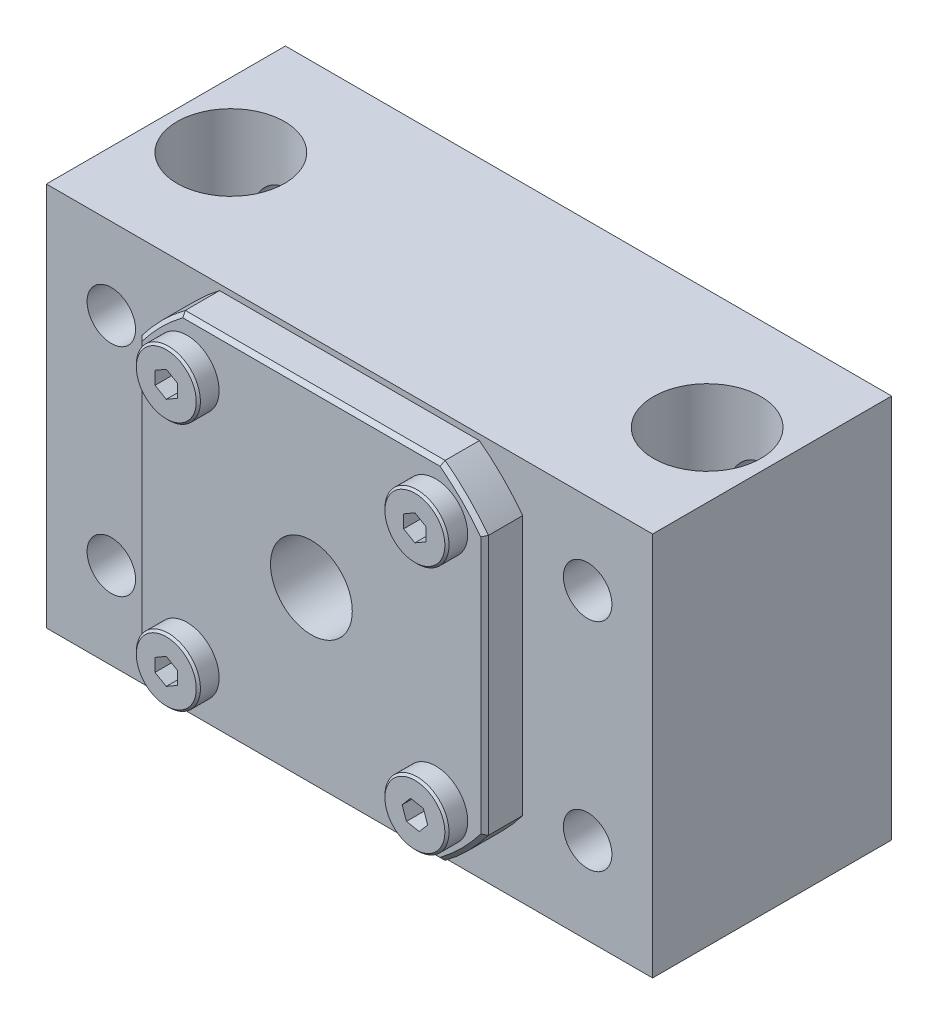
from build123d import *

# Parameters (mm, degrees)
SKETCH1_W           = 88.9
SKETCH1_H           = 35.052
EXTRUDE_B_DEPTH     = 56.388
SKETCH2_R           = 5.207
PHOLES_DEPTH        = 111.957015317
SKETCH3_R           = 7.874
PCBOREDDEPTH_DEPTH  = 25.4
SKETCH4_R           = 3.556
CUT_EXTRUDE3_DEPTH  = 111.957015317
SKETCH5_R           = 6
CUT_EXTRUDE4_DEPTH  = 111.957015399
SQCOVER_START       = 5.588
SKETCH8_W           = 50.8
SKETCH8_H           = 50.8
SKETCH8_R           = 6
SQCOVER_DEPTH       = 5.588
SKETCH9_R           = 152.4
SKETCH9_R_2         = 31.75
CUT_EXTRUDE6_DEPTH  = 5.588
SQCOVERCHAMFER_SIZE = 0.5588
SKETCH10_R          = 4.699
SHCS_DEPTH          = 3.048
SHCS_CHAMFER_SIZE   = 0.3048


with BuildPart() as part:
    # Sketch1 → Extrude B (new body)
    with BuildSketch(Plane(origin=(0, 0, 0), x_dir=(1, 0, 0), z_dir=(0, 1, 0))):
        with Locations((44.45, 17.526)):
            Rectangle(SKETCH1_W, SKETCH1_H)
    extrude(amount=EXTRUDE_B_DEPTH)

    # Sketch2 → PHoles (cut, through all)
    with BuildSketch(Plane(origin=(0, 56.388, 0), x_dir=(-1, 0, 0), z_dir=(0, 1, 0))):
        with Locations(Location((-79.375, -17.526, 0), (0, 0, 90))):
            Circle(SKETCH2_R)
        with Locations(Location((-9.525, -17.526, 0), (0, 0, 90))):
            Circle(SKETCH2_R)
        with Locations((-79.375, 25.908)):
            Circle(SKETCH2_R)
        with Locations((-9.525, 25.908)):
            Circle(SKETCH2_R)
    extrude(amount=-PHOLES_DEPTH, mode=Mode.SUBTRACT)

    # Sketch3 → PcBoredDepth (cut)
    with BuildSketch(Plane(origin=(0, 56.388, 0), x_dir=(-1, 0, 0), z_dir=(0, 1, 0))):
        with Locations(Location((-9.525, -17.526, 0), (0, 0, 90))):
            Circle(SKETCH3_R)
        with Locations(Location((-79.375, -17.526, 0), (0, 0, 90))):
            Circle(SKETCH3_R)
        with Locations((-79.375, 25.908)):
            Circle(SKETCH3_R)
        with Locations((-9.525, 25.908)):
            Circle(SKETCH3_R)
    extrude(amount=-PCBOREDDEPTH_DEPTH, mode=Mode.SUBTRACT)

    # Sketch4 → Cut-Extrude3 (cut, through all)
    with BuildSketch(Plane.XY):
        with Locations((9.525, 44.45)):
            Circle(SKETCH4_R)
        with Locations((9.525, 12.7)):
            Circle(SKETCH4_R)
        with Locations((79.375, 44.45)):
            Circle(SKETCH4_R)
        with Locations((79.375, 12.7)):
            Circle(SKETCH4_R)
        with Locations((9.525, 76.2)):
            Circle(SKETCH4_R)
        with Locations((79.375, 76.2)):
            Circle(SKETCH4_R)
    extrude(amount=-CUT_EXTRUDE3_DEPTH, mode=Mode.SUBTRACT)

    # Sketch5 → Cut-Extrude4 (cut, through all)
    with BuildSketch(Plane.XY):
        with Locations((44.45, 30.1498)):
            Circle(SKETCH5_R)
    extrude(amount=-CUT_EXTRUDE4_DEPTH, mode=Mode.SUBTRACT)

    # Sketch8 → SqCover (add)
    with BuildSketch(Plane.XY.offset(SQCOVER_START)):
        with Locations((44.45, 30.1498)):
            Rectangle(SKETCH8_W, SKETCH8_H)
        with Locations((44.45, 30.1498)):
            Circle(SKETCH8_R, mode=Mode.SUBTRACT)
    extrude(amount=-SQCOVER_DEPTH)

    # Sketch9 → Cut-Extrude6 (cut)
    with BuildSketch(Plane.XY.offset(5.588)):
        with Locations((44.45, 30.1498)):
            Circle(SKETCH9_R)
        with Locations((44.45, 30.1498)):
            Circle(SKETCH9_R_2, mode=Mode.SUBTRACT)
    extrude(amount=-CUT_EXTRUDE6_DEPTH, mode=Mode.SUBTRACT)

    # SqCoverChamfer
    sqcoverchamfer_edges = [part.edges().sort_by_distance(p)[0] for p in [
        (21.999359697, 52.600440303, 5.588),
        (21.999359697, 7.699159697, 5.588),
        (66.900640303, 7.699159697, 5.588),
        (66.900640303, 52.600440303, 5.588),
        (44.45, 55.5498, 5.588),
        (69.85, 30.1498, 5.588),
        (44.45, 4.7498, 5.588),
        (19.05, 30.1498, 5.588),
    ]]
    chamfer(sqcoverchamfer_edges, length=SQCOVERCHAMFER_SIZE)

    # Sketch10 → SHCS (add)
    # profile 1 of 4: a face of its own
    with BuildSketch(Plane.XY.offset(5.588)):
        with Locations(Location((26.220080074, 48.379719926, 0), (0, 0, 180))):
            Circle(SKETCH10_R)
        Polygon((26.220080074, 46.473309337), (27.871080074, 47.426514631), (27.871080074, 49.33292522), (26.220080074, 50.286130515), (24.569080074, 49.33292522), (24.569080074, 47.426514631), align=None, mode=Mode.SUBTRACT)
    # profile 2 of 4: a face of its own
    with BuildSketch(Plane.XY.offset(5.588)):
        with Locations(Location((62.679919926, 48.379719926, 0), (0, 0, 180))):
            Circle(SKETCH10_R)
        Polygon((62.679919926, 46.473309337), (64.330919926, 47.426514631), (64.330919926, 49.33292522), (62.679919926, 50.286130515), (61.028919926, 49.33292522), (61.028919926, 47.426514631), align=None, mode=Mode.SUBTRACT)
    # profile 3 of 4: a face of its own
    with BuildSketch(Plane.XY.offset(5.588)):
        with Locations(Location((62.679919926, 11.919880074, 0), (0, 0, 180))):
            Circle(SKETCH10_R)
        Polygon((63.311943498, 10.121284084), (64.553561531, 11.567930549), (63.921537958, 13.366526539), (62.047896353, 13.718476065), (60.806278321, 12.2718296), (61.438301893, 10.473233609), align=None, mode=Mode.SUBTRACT)
    # profile 4 of 4: a face of its own
    with BuildSketch(Plane.XY.offset(5.588)):
        with Locations(Location((26.220080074, 11.919880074, 0), (0, 0, 180))):
            Circle(SKETCH10_R)
        Polygon((26.220080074, 10.013469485), (27.871080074, 10.96667478), (27.871080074, 12.873085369), (26.220080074, 13.826290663), (24.569080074, 12.873085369), (24.569080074, 10.96667478), align=None, mode=Mode.SUBTRACT)
    extrude(amount=SHCS_DEPTH)

    # SHCS.Chamfer
    shcs_chamfer_edges = [part.edges().sort_by_distance(p)[0] for p in [
        (30.919080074, 48.379719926, 8.636),
        (67.378919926, 48.379719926, 8.636),
        (67.378919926, 11.919880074, 8.636),
        (30.919080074, 11.919880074, 8.636),
    ]]
    chamfer(shcs_chamfer_edges, length=SHCS_CHAMFER_SIZE)


solid = part.part
